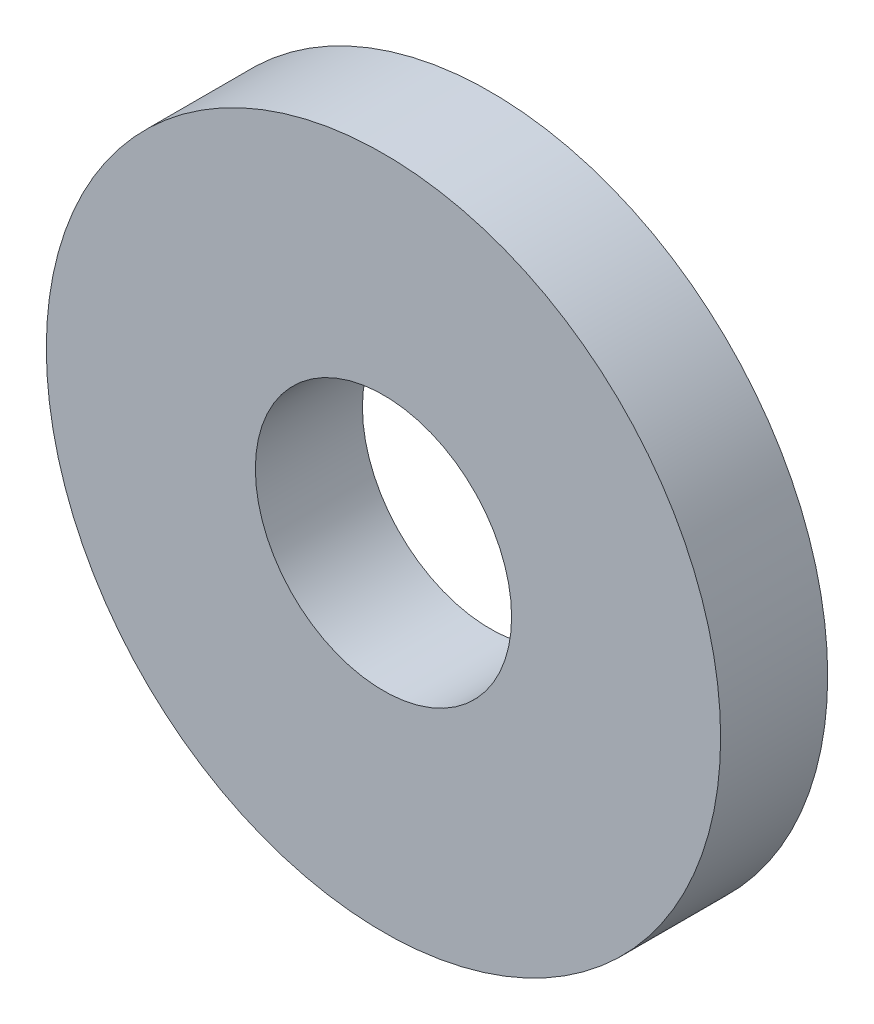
ISO-10303-21;
HEADER;
FILE_DESCRIPTION(('STEP AP214'),'2;1');
FILE_NAME('part.step','',(''),(''),'','','');
FILE_SCHEMA(('AUTOMOTIVE_DESIGN { 1 0 10303 214 1 1 1 1 }'));
ENDSEC;
DATA;
#1=APPLICATION_CONTEXT('core data for automotive mechanical design processes');
#2=APPLICATION_PROTOCOL_DEFINITION('international standard','automotive_design',2000,#1);
#3=PRODUCT_CONTEXT('',#1,'mechanical');
#4=PRODUCT('Part','Part','',(#3));
#5=PRODUCT_RELATED_PRODUCT_CATEGORY('part','',(#4));
#6=PRODUCT_DEFINITION_FORMATION('','',#4);
#7=PRODUCT_DEFINITION_CONTEXT('part definition',#1,'design');
#8=PRODUCT_DEFINITION('design','',#6,#7);
#9=PRODUCT_DEFINITION_SHAPE('','',#8);
#10=(LENGTH_UNIT() NAMED_UNIT(*) SI_UNIT(.MILLI.,.METRE.));
#11=(NAMED_UNIT(*) PLANE_ANGLE_UNIT() SI_UNIT($,.RADIAN.));
#12=(NAMED_UNIT(*) SI_UNIT($,.STERADIAN.) SOLID_ANGLE_UNIT());
#13=UNCERTAINTY_MEASURE_WITH_UNIT(LENGTH_MEASURE(1.E-05),#10,'distance_accuracy_value','');
#14=(GEOMETRIC_REPRESENTATION_CONTEXT(3) GLOBAL_UNCERTAINTY_ASSIGNED_CONTEXT((#13)) GLOBAL_UNIT_ASSIGNED_CONTEXT((#10,
#11,#12)) REPRESENTATION_CONTEXT('',''));
#15=CARTESIAN_POINT('',(0.,0.,0.));
#16=DIRECTION('',(0.,0.,1.));
#17=DIRECTION('',(1.,0.,0.));
#18=AXIS2_PLACEMENT_3D('',#15,#16,#17);
#19=CARTESIAN_POINT('',(7.17846990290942E-13,190.,3.175));
#20=DIRECTION('',(0.,0.,1.));
#21=DIRECTION('',(1.,0.,0.));
#22=AXIS2_PLACEMENT_3D('',#19,#20,#21);
#23=PLANE('',#22);
#24=CARTESIAN_POINT('',(7.17846990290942E-13,190.,3.175));
#25=DIRECTION('',(0.,0.,1.));
#26=DIRECTION('',(1.,0.,0.));
#27=AXIS2_PLACEMENT_3D('',#24,#25,#26);
#28=CIRCLE('',#27,10.);
#29=CARTESIAN_POINT('',(10.0000000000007,190.,3.175));
#30=VERTEX_POINT('',#29);
#31=EDGE_CURVE('E10',#30,#30,#28,.T.);
#32=ORIENTED_EDGE('',*,*,#31,.T.);
#33=EDGE_LOOP('',(#32));
#34=FACE_BOUND('',#33,.T.);
#35=CARTESIAN_POINT('',(7.17846990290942E-13,190.,3.175));
#36=DIRECTION('',(0.,0.,1.));
#37=DIRECTION('',(1.,0.,0.));
#38=AXIS2_PLACEMENT_3D('',#35,#36,#37);
#39=CIRCLE('',#38,3.8);
#40=CARTESIAN_POINT('',(3.80000000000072,190.,3.175));
#41=VERTEX_POINT('',#40);
#42=EDGE_CURVE('E47',#41,#41,#39,.T.);
#43=ORIENTED_EDGE('',*,*,#42,.F.);
#44=EDGE_LOOP('',(#43));
#45=FACE_BOUND('',#44,.T.);
#46=ADVANCED_FACE('F36',(#34,#45),#23,.T.);
#47=CARTESIAN_POINT('',(7.17846990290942E-13,190.,0.));
#48=DIRECTION('',(0.,0.,1.));
#49=DIRECTION('',(1.,0.,0.));
#50=AXIS2_PLACEMENT_3D('',#47,#48,#49);
#51=PLANE('',#50);
#52=CARTESIAN_POINT('',(7.17846990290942E-13,190.,0.));
#53=DIRECTION('',(0.,0.,1.));
#54=DIRECTION('',(1.,0.,0.));
#55=AXIS2_PLACEMENT_3D('',#52,#53,#54);
#56=CIRCLE('',#55,10.);
#57=CARTESIAN_POINT('',(10.0000000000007,190.,0.));
#58=VERTEX_POINT('',#57);
#59=EDGE_CURVE('E40',#58,#58,#56,.T.);
#60=ORIENTED_EDGE('',*,*,#59,.F.);
#61=EDGE_LOOP('',(#60));
#62=FACE_BOUND('',#61,.T.);
#63=CARTESIAN_POINT('',(7.17846990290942E-13,190.,0.));
#64=DIRECTION('',(0.,0.,1.));
#65=DIRECTION('',(1.,0.,0.));
#66=AXIS2_PLACEMENT_3D('',#63,#64,#65);
#67=CIRCLE('',#66,3.8);
#68=CARTESIAN_POINT('',(3.80000000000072,190.,0.));
#69=VERTEX_POINT('',#68);
#70=EDGE_CURVE('E49',#69,#69,#67,.T.);
#71=ORIENTED_EDGE('',*,*,#70,.T.);
#72=EDGE_LOOP('',(#71));
#73=FACE_BOUND('',#72,.T.);
#74=ADVANCED_FACE('F59',(#62,#73),#51,.F.);
#75=CARTESIAN_POINT('',(7.17846990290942E-13,190.,3.175));
#76=DIRECTION('',(0.,0.,-1.));
#77=DIRECTION('',(-1.,0.,0.));
#78=AXIS2_PLACEMENT_3D('',#75,#76,#77);
#79=CYLINDRICAL_SURFACE('',#78,10.);
#80=ORIENTED_EDGE('',*,*,#31,.F.);
#81=EDGE_LOOP('',(#80));
#82=FACE_BOUND('',#81,.T.);
#83=ORIENTED_EDGE('',*,*,#59,.T.);
#84=EDGE_LOOP('',(#83));
#85=FACE_BOUND('',#84,.T.);
#86=ADVANCED_FACE('F38',(#82,#85),#79,.T.);
#87=CARTESIAN_POINT('',(7.17846990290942E-13,190.,3.175));
#88=DIRECTION('',(0.,0.,-1.));
#89=DIRECTION('',(-1.,0.,0.));
#90=AXIS2_PLACEMENT_3D('',#87,#88,#89);
#91=CYLINDRICAL_SURFACE('',#90,3.8);
#92=ORIENTED_EDGE('',*,*,#42,.T.);
#93=EDGE_LOOP('',(#92));
#94=FACE_BOUND('',#93,.T.);
#95=ORIENTED_EDGE('',*,*,#70,.F.);
#96=EDGE_LOOP('',(#95));
#97=FACE_BOUND('',#96,.T.);
#98=ADVANCED_FACE('F55',(#94,#97),#91,.F.);
#99=CLOSED_SHELL('',(#46,#74,#86,#98));
#100=MANIFOLD_SOLID_BREP('B2',#99);
#101=ADVANCED_BREP_SHAPE_REPRESENTATION('',(#18,#100),#14);
#102=SHAPE_DEFINITION_REPRESENTATION(#9,#101);
ENDSEC;
END-ISO-10303-21;
